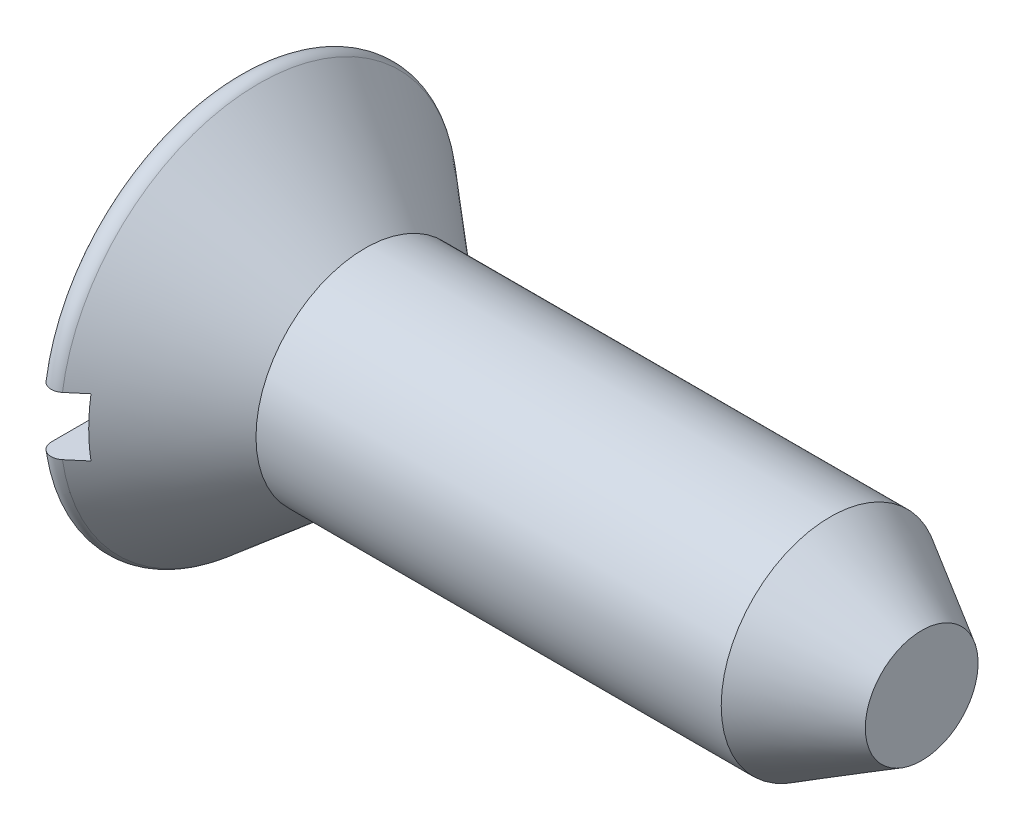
ISO-10303-21;
HEADER;
FILE_DESCRIPTION(('STEP AP214'),'2;1');
FILE_NAME('part.step','',(''),(''),'','','');
FILE_SCHEMA(('AUTOMOTIVE_DESIGN { 1 0 10303 214 1 1 1 1 }'));
ENDSEC;
DATA;
#1=APPLICATION_CONTEXT('core data for automotive mechanical design processes');
#2=APPLICATION_PROTOCOL_DEFINITION('international standard','automotive_design',2000,#1);
#3=PRODUCT_CONTEXT('',#1,'mechanical');
#4=PRODUCT('Part','Part','',(#3));
#5=PRODUCT_RELATED_PRODUCT_CATEGORY('part','',(#4));
#6=PRODUCT_DEFINITION_FORMATION('','',#4);
#7=PRODUCT_DEFINITION_CONTEXT('part definition',#1,'design');
#8=PRODUCT_DEFINITION('design','',#6,#7);
#9=PRODUCT_DEFINITION_SHAPE('','',#8);
#10=(LENGTH_UNIT() NAMED_UNIT(*) SI_UNIT(.MILLI.,.METRE.));
#11=(NAMED_UNIT(*) PLANE_ANGLE_UNIT() SI_UNIT($,.RADIAN.));
#12=(NAMED_UNIT(*) SI_UNIT($,.STERADIAN.) SOLID_ANGLE_UNIT());
#13=UNCERTAINTY_MEASURE_WITH_UNIT(LENGTH_MEASURE(1.E-05),#10,'distance_accuracy_value','');
#14=(GEOMETRIC_REPRESENTATION_CONTEXT(3) GLOBAL_UNCERTAINTY_ASSIGNED_CONTEXT((#13)) GLOBAL_UNIT_ASSIGNED_CONTEXT((#10,
#11,#12)) REPRESENTATION_CONTEXT('',''));
#15=CARTESIAN_POINT('',(0.,0.,0.));
#16=DIRECTION('',(0.,0.,1.));
#17=DIRECTION('',(1.,0.,0.));
#18=AXIS2_PLACEMENT_3D('',#15,#16,#17);
#19=CARTESIAN_POINT('',(0.,0.,0.));
#20=DIRECTION('',(-1.,0.,0.));
#21=DIRECTION('',(0.,0.,1.));
#22=AXIS2_PLACEMENT_3D('',#19,#20,#21);
#23=CYLINDRICAL_SURFACE('',#22,0.762);
#24=CARTESIAN_POINT('',(0.889,0.,0.));
#25=DIRECTION('',(-1.,0.,0.));
#26=DIRECTION('',(0.,0.,1.));
#27=AXIS2_PLACEMENT_3D('',#24,#25,#26);
#28=CIRCLE('',#27,0.762);
#29=CARTESIAN_POINT('',(0.889,0.,0.762));
#30=VERTEX_POINT('',#29);
#31=EDGE_CURVE('E174',#30,#30,#28,.T.);
#32=ORIENTED_EDGE('',*,*,#31,.F.);
#33=EDGE_LOOP('',(#32));
#34=FACE_BOUND('',#33,.T.);
#35=CARTESIAN_POINT('',(4.13728568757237,0.,0.));
#36=DIRECTION('',(-1.,0.,0.));
#37=DIRECTION('',(0.,0.,1.));
#38=AXIS2_PLACEMENT_3D('',#35,#36,#37);
#39=CIRCLE('',#38,0.762);
#40=CARTESIAN_POINT('',(4.13728568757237,0.,0.762));
#41=VERTEX_POINT('',#40);
#42=EDGE_CURVE('E227',#41,#41,#39,.T.);
#43=ORIENTED_EDGE('',*,*,#42,.T.);
#44=EDGE_LOOP('',(#43));
#45=FACE_BOUND('',#44,.T.);
#46=ADVANCED_FACE('F76',(#34,#45),#23,.T.);
#47=CARTESIAN_POINT('',(0.,0.,0.));
#48=DIRECTION('',(1.,0.,0.));
#49=DIRECTION('',(0.,0.,-1.));
#50=AXIS2_PLACEMENT_3D('',#47,#48,#49);
#51=PLANE('',#50);
#52=CARTESIAN_POINT('',(0.,0.,0.));
#53=DIRECTION('',(-1.,0.,0.));
#54=DIRECTION('',(0.,0.,1.));
#55=AXIS2_PLACEMENT_3D('',#52,#53,#54);
#56=CIRCLE('',#55,1.3173129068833);
#57=CARTESIAN_POINT('',(0.,0.2032,1.30154640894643));
#58=VERTEX_POINT('',#57);
#59=CARTESIAN_POINT('',(0.,0.2032,-1.30154640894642));
#60=VERTEX_POINT('',#59);
#61=EDGE_CURVE('E163',#58,#60,#56,.T.);
#62=ORIENTED_EDGE('',*,*,#61,.T.);
#63=DIRECTION('',(0.,0.,1.));
#64=VECTOR('',#63,1.);
#65=CARTESIAN_POINT('',(0.,0.2032,-1.4062129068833));
#66=LINE('',#65,#64);
#67=EDGE_CURVE('E211',#60,#58,#66,.T.);
#68=ORIENTED_EDGE('',*,*,#67,.T.);
#69=EDGE_LOOP('',(#62,#68));
#70=FACE_BOUND('',#69,.T.);
#71=ADVANCED_FACE('F239',(#70),#51,.F.);
#72=CARTESIAN_POINT('',(0.0889,0.,0.));
#73=DIRECTION('',(-1.,0.,0.));
#74=DIRECTION('',(0.,0.,1.));
#75=AXIS2_PLACEMENT_3D('',#72,#73,#74);
#76=TOROIDAL_SURFACE('',#75,1.3173129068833,0.0889000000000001);
#77=CARTESIAN_POINT('',(0.146043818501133,0.,0.));
#78=DIRECTION('',(-1.,0.,0.));
#79=DIRECTION('',(0.,0.,1.));
#80=AXIS2_PLACEMENT_3D('',#77,#78,#79);
#81=CIRCLE('',#80,1.38541425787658);
#82=CARTESIAN_POINT('',(0.146043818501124,0.2032,1.3704314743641));
#83=VERTEX_POINT('',#82);
#84=CARTESIAN_POINT('',(0.146043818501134,0.2032,-1.37043147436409));
#85=VERTEX_POINT('',#84);
#86=EDGE_CURVE('E170',#83,#85,#81,.T.);
#87=ORIENTED_EDGE('',*,*,#86,.T.);
#88=CARTESIAN_POINT('',(0.0523705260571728,0.2032,-1.38351851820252));
#89=CARTESIAN_POINT('',(0.0478176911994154,0.2032,-1.38144422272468));
#90=CARTESIAN_POINT('',(0.0434378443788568,0.2032,-1.37898096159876));
#91=CARTESIAN_POINT('',(0.0351518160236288,0.2032,-1.37334990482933));
#92=CARTESIAN_POINT('',(0.0312462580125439,0.2032,-1.37018119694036));
#93=CARTESIAN_POINT('',(0.0240245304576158,0.2032,-1.36323710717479));
#94=CARTESIAN_POINT('',(0.0207078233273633,0.2032,-1.35946228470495));
#95=CARTESIAN_POINT('',(0.0147503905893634,0.2032,-1.35141429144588));
#96=CARTESIAN_POINT('',(0.0121095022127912,0.2032,-1.34714124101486));
#97=CARTESIAN_POINT('',(0.00755405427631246,0.2032,-1.33818164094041));
#98=CARTESIAN_POINT('',(0.00564538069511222,0.2032,-1.33349209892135));
#99=CARTESIAN_POINT('',(0.00263372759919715,0.2032,-1.32386086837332));
#100=CARTESIAN_POINT('',(0.00153082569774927,0.2032,-1.31891915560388));
#101=CARTESIAN_POINT('',(0.000152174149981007,0.2032,-1.30887237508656));
#102=CARTESIAN_POINT('',(-0.000115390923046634,0.2032,-1.30376618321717));
#103=CARTESIAN_POINT('',(0.000206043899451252,0.2032,-1.29358074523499));
#104=CARTESIAN_POINT('',(0.000795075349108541,0.2032,-1.28850150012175));
#105=CARTESIAN_POINT('',(0.00281857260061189,0.2032,-1.27848876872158));
#106=CARTESIAN_POINT('',(0.00425707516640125,0.2032,-1.27355609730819));
#107=CARTESIAN_POINT('',(0.00794412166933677,0.2032,-1.26400323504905));
#108=CARTESIAN_POINT('',(0.0101926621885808,0.2032,-1.25938304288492));
#109=CARTESIAN_POINT('',(0.015431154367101,0.2032,-1.25060241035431));
#110=CARTESIAN_POINT('',(0.0184188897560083,0.2032,-1.24644064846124));
#111=CARTESIAN_POINT('',(0.025057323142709,0.2032,-1.23868432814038));
#112=CARTESIAN_POINT('',(0.0287079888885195,0.2032,-1.23508974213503));
#113=CARTESIAN_POINT('',(0.036529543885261,0.2032,-1.22861027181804));
#114=CARTESIAN_POINT('',(0.0406947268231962,0.2032,-1.2257185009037));
#115=CARTESIAN_POINT('',(0.049456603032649,0.2032,-1.22068615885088));
#116=CARTESIAN_POINT('',(0.0540532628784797,0.2032,-1.21854552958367));
#117=CARTESIAN_POINT('',(0.0634830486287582,0.2032,-1.21510523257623));
#118=CARTESIAN_POINT('',(0.068312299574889,0.2032,-1.21379494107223));
#119=CARTESIAN_POINT('',(0.0781229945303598,0.2032,-1.21201227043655));
#120=CARTESIAN_POINT('',(0.0831044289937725,0.2032,-1.21153983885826));
#121=CARTESIAN_POINT('',(0.0930285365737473,0.2032,-1.21144808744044));
#122=CARTESIAN_POINT('',(0.0979711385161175,0.2032,-1.21182086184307));
#123=CARTESIAN_POINT('',(0.107723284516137,0.2032,-1.21339163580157));
#124=CARTESIAN_POINT('',(0.112532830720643,0.2032,-1.21458962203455));
#125=CARTESIAN_POINT('',(0.121880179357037,0.2032,-1.21777299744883));
#126=CARTESIAN_POINT('',(0.126418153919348,0.2032,-1.21975788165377));
#127=CARTESIAN_POINT('',(0.135100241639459,0.2032,-1.22445530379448));
#128=CARTESIAN_POINT('',(0.139244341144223,0.2032,-1.2271678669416));
#129=CARTESIAN_POINT('',(0.147058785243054,0.2032,-1.23326619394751));
#130=CARTESIAN_POINT('',(0.150724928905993,0.2032,-1.23665733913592));
#131=CARTESIAN_POINT('',(0.157444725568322,0.2032,-1.2440000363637));
#132=CARTESIAN_POINT('',(0.160498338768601,0.2032,-1.24795162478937));
#133=CARTESIAN_POINT('',(0.165947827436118,0.2032,-1.25635718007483));
#134=CARTESIAN_POINT('',(0.168334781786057,0.2032,-1.2608169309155));
#135=CARTESIAN_POINT('',(0.172335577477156,0.2032,-1.27007068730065));
#136=CARTESIAN_POINT('',(0.17394936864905,0.2032,-1.27486471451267));
#137=CARTESIAN_POINT('',(0.176375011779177,0.2032,-1.28470805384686));
#138=CARTESIAN_POINT('',(0.177177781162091,0.2032,-1.28975960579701));
#139=CARTESIAN_POINT('',(0.177928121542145,0.2032,-1.29992591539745));
#140=CARTESIAN_POINT('',(0.177875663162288,0.2032,-1.30504067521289));
#141=CARTESIAN_POINT('',(0.176913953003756,0.2032,-1.31521251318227));
#142=CARTESIAN_POINT('',(0.176000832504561,0.2032,-1.32026922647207));
#143=CARTESIAN_POINT('',(0.173335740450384,0.2032,-1.33015669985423));
#144=CARTESIAN_POINT('',(0.171583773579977,0.2032,-1.33498746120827));
#145=CARTESIAN_POINT('',(0.1672950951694,0.2032,-1.34426719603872));
#146=CARTESIAN_POINT('',(0.164761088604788,0.2032,-1.34871741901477));
#147=CARTESIAN_POINT('',(0.158975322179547,0.2032,-1.35712403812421));
#148=CARTESIAN_POINT('',(0.155723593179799,0.2032,-1.36108045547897));
#149=CARTESIAN_POINT('',(0.148626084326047,0.2032,-1.3683476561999));
#150=CARTESIAN_POINT('',(0.144786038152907,0.2032,-1.371664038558));
#151=CARTESIAN_POINT('',(0.136598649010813,0.2032,-1.3775964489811));
#152=CARTESIAN_POINT('',(0.13225135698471,0.2032,-1.38021254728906));
#153=CARTESIAN_POINT('',(0.123223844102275,0.2032,-1.38464056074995));
#154=CARTESIAN_POINT('',(0.118547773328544,0.2032,-1.38646093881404));
#155=CARTESIAN_POINT('',(0.108953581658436,0.2032,-1.38928396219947));
#156=CARTESIAN_POINT('',(0.104035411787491,0.2032,-1.39028644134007));
#157=CARTESIAN_POINT('',(0.0941387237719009,0.2032,-1.39143812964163));
#158=CARTESIAN_POINT('',(0.0891609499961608,0.2032,-1.39159377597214));
#159=CARTESIAN_POINT('',(0.0792546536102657,0.2032,-1.39106395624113));
#160=CARTESIAN_POINT('',(0.0743260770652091,0.2032,-1.39037954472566));
#161=CARTESIAN_POINT('',(0.0665501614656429,0.2032,-1.38862203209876));
#162=CARTESIAN_POINT('',(0.0636423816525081,0.2032,-1.38780545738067));
#163=CARTESIAN_POINT('',(0.0579255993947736,0.2032,-1.38587926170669));
#164=CARTESIAN_POINT('',(0.0551165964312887,0.2032,-1.38476964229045));
#165=CARTESIAN_POINT('',(0.0523705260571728,0.2032,-1.38351851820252));
#166=B_SPLINE_CURVE_WITH_KNOTS('',3,(#88,#89,#90,#91,#92,#93,#94,#95,#96,#97,#98,#99,#100,#101,
#102,#103,#104,#105,#106,#107,#108,#109,#110,#111,#112,#113,#114,#115,#116,#117,#118,#119,#120,
#121,#122,#123,#124,#125,#126,#127,#128,#129,#130,#131,#132,#133,#134,#135,#136,#137,#138,#139,
#140,#141,#142,#143,#144,#145,#146,#147,#148,#149,#150,#151,#152,#153,#154,#155,#156,#157,#158,
#159,#160,#161,#162,#163,#164,#165),.UNSPECIFIED.,.T.,.F.,(4,2,2,2,2,2,2,2,2,2,2,2,2,2,2,2,2,2,
2,2,2,2,2,2,2,2,2,2,2,2,2,2,2,2,2,2,2,2,4),(0.,0.0149981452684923,0.030015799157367,
0.0450196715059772,0.0600199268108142,0.075138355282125,0.0902582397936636,0.105525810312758,
0.120793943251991,0.136135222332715,0.151476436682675,0.166772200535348,0.182067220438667,
0.197205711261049,0.212343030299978,0.227282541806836,0.242221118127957,0.257020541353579,
0.271819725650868,0.286609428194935,0.301399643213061,0.316312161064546,0.331225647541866,
0.346330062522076,0.361435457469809,0.37670820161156,0.391981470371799,0.4073237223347,
0.422665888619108,0.437955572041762,0.453244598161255,0.468393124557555,0.483540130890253,
0.498521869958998,0.513506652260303,0.528377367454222,0.543229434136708,0.552275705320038,
0.561321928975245),.UNSPECIFIED.);
#167=EDGE_CURVE('E182',#85,#60,#166,.T.);
#168=ORIENTED_EDGE('',*,*,#167,.T.);
#169=ORIENTED_EDGE('',*,*,#61,.F.);
#170=CARTESIAN_POINT('',(0.0505339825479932,0.2032,1.22031559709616));
#171=CARTESIAN_POINT('',(0.046022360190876,0.2032,1.22250397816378));
#172=CARTESIAN_POINT('',(0.0416938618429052,0.2032,1.22507887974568));
#173=CARTESIAN_POINT('',(0.0335289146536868,0.2032,1.23092350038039));
#174=CARTESIAN_POINT('',(0.0296931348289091,0.2032,1.23419414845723));
#175=CARTESIAN_POINT('',(0.0226268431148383,0.2032,1.24132795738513));
#176=CARTESIAN_POINT('',(0.019395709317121,0.2032,1.24519050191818));
#177=CARTESIAN_POINT('',(0.0136214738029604,0.2032,1.25339760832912));
#178=CARTESIAN_POINT('',(0.0110782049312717,0.2032,1.25774205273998));
#179=CARTESIAN_POINT('',(0.00672420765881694,0.2032,1.26683485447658));
#180=CARTESIAN_POINT('',(0.00492070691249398,0.2032,1.271586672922));
#181=CARTESIAN_POINT('',(0.00212891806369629,0.2032,1.28132430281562));
#182=CARTESIAN_POINT('',(0.00114070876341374,0.2032,1.28631013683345));
#183=CARTESIAN_POINT('',(8.02056667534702E-07,0.2032,1.29642193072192));
#184=CARTESIAN_POINT('',(-0.000143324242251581,0.2032,1.30154874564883));
#185=CARTESIAN_POINT('',(0.000429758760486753,0.2032,1.31175411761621));
#186=CARTESIAN_POINT('',(0.00114698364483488,0.2032,1.31683267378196));
#187=CARTESIAN_POINT('',(0.00342616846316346,0.2032,1.3268042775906));
#188=CARTESIAN_POINT('',(0.0049893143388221,0.2032,1.33169705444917));
#189=CARTESIAN_POINT('',(0.00891975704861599,0.2032,1.34114832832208));
#190=CARTESIAN_POINT('',(0.0112870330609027,0.2032,1.3457068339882));
#191=CARTESIAN_POINT('',(0.0167446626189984,0.2032,1.35432961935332));
#192=CARTESIAN_POINT('',(0.0198305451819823,0.2032,1.3583967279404));
#193=CARTESIAN_POINT('',(0.0266478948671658,0.2032,1.36594827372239));
#194=CARTESIAN_POINT('',(0.0303793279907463,0.2032,1.3694327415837));
#195=CARTESIAN_POINT('',(0.0383405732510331,0.2032,1.37568129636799));
#196=CARTESIAN_POINT('',(0.0425648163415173,0.2032,1.37845247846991));
#197=CARTESIAN_POINT('',(0.0514223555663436,0.2032,1.38323774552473));
#198=CARTESIAN_POINT('',(0.0560556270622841,0.2032,1.38525187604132));
#199=CARTESIAN_POINT('',(0.0655486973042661,0.2032,1.38844509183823));
#200=CARTESIAN_POINT('',(0.0704056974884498,0.2032,1.3896324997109));
#201=CARTESIAN_POINT('',(0.0802504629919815,0.2032,1.39116939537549));
#202=CARTESIAN_POINT('',(0.085238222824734,0.2032,1.39151891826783));
#203=CARTESIAN_POINT('',(0.0951701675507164,0.2032,1.39136993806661));
#204=CARTESIAN_POINT('',(0.100114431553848,0.2032,1.39087664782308));
#205=CARTESIAN_POINT('',(0.109849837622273,0.2032,1.38906691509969));
#206=CARTESIAN_POINT('',(0.114640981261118,0.2032,1.38775048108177));
#207=CARTESIAN_POINT('',(0.123935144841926,0.2032,1.3843337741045));
#208=CARTESIAN_POINT('',(0.128438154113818,0.2032,1.38223347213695));
#209=CARTESIAN_POINT('',(0.137030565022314,0.2032,1.37731112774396));
#210=CARTESIAN_POINT('',(0.141119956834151,0.2032,1.37448906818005));
#211=CARTESIAN_POINT('',(0.148796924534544,0.2032,1.36818585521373));
#212=CARTESIAN_POINT('',(0.152381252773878,0.2032,1.36470074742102));
#213=CARTESIAN_POINT('',(0.158921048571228,0.2032,1.35718357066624));
#214=CARTESIAN_POINT('',(0.161876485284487,0.2032,1.35315147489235));
#215=CARTESIAN_POINT('',(0.167106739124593,0.2032,1.34461137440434));
#216=CARTESIAN_POINT('',(0.169374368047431,0.2032,1.34009896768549));
#217=CARTESIAN_POINT('',(0.173128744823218,0.2032,1.33076025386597));
#218=CARTESIAN_POINT('',(0.174615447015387,0.2032,1.32593392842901));
#219=CARTESIAN_POINT('',(0.176781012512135,0.2032,1.3160508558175));
#220=CARTESIAN_POINT('',(0.17745135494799,0.2032,1.31099224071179));
#221=CARTESIAN_POINT('',(0.177939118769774,0.2032,1.30083399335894));
#222=CARTESIAN_POINT('',(0.17775650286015,0.2032,1.29573435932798));
#223=CARTESIAN_POINT('',(0.17653988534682,0.2032,1.28560487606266));
#224=CARTESIAN_POINT('',(0.175500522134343,0.2032,1.28057566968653));
#225=CARTESIAN_POINT('',(0.172591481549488,0.2032,1.27076324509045));
#226=CARTESIAN_POINT('',(0.170721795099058,0.2032,1.26598002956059));
#227=CARTESIAN_POINT('',(0.166204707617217,0.2032,1.25680196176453));
#228=CARTESIAN_POINT('',(0.163558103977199,0.2032,1.25240671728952));
#229=CARTESIAN_POINT('',(0.157558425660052,0.2032,1.24412800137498));
#230=CARTESIAN_POINT('',(0.154205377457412,0.2032,1.24024451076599));
#231=CARTESIAN_POINT('',(0.146918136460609,0.2032,1.23313728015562));
#232=CARTESIAN_POINT('',(0.14298928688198,0.2032,1.22990806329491));
#233=CARTESIAN_POINT('',(0.134639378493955,0.2032,1.22416552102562));
#234=CARTESIAN_POINT('',(0.130218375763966,0.2032,1.22165211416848));
#235=CARTESIAN_POINT('',(0.121071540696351,0.2032,1.21744707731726));
#236=CARTESIAN_POINT('',(0.116350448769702,0.2032,1.21574513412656));
#237=CARTESIAN_POINT('',(0.106686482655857,0.2032,1.21316740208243));
#238=CARTESIAN_POINT('',(0.101743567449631,0.2032,1.2122917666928));
#239=CARTESIAN_POINT('',(0.0918327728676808,0.2032,1.21139933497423));
#240=CARTESIAN_POINT('',(0.0868656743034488,0.2032,1.21137379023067));
#241=CARTESIAN_POINT('',(0.0770026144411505,0.2032,1.21216050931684));
#242=CARTESIAN_POINT('',(0.0721065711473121,0.2032,1.21297171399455));
#243=CARTESIAN_POINT('',(0.0644247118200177,0.2032,1.21492056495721));
#244=CARTESIAN_POINT('',(0.0615712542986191,0.2032,1.21580160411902));
#245=CARTESIAN_POINT('',(0.0559682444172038,0.2032,1.21784800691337));
#246=CARTESIAN_POINT('',(0.0532186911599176,0.2032,1.21901336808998));
#247=CARTESIAN_POINT('',(0.0505339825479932,0.2032,1.22031559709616));
#248=B_SPLINE_CURVE_WITH_KNOTS('',3,(#170,#171,#172,#173,#174,#175,#176,#177,#178,#179,#180,
#181,#182,#183,#184,#185,#186,#187,#188,#189,#190,#191,#192,#193,#194,#195,#196,#197,#198,#199,
#200,#201,#202,#203,#204,#205,#206,#207,#208,#209,#210,#211,#212,#213,#214,#215,#216,#217,#218,
#219,#220,#221,#222,#223,#224,#225,#226,#227,#228,#229,#230,#231,#232,#233,#234,#235,#236,#237,
#238,#239,#240,#241,#242,#243,#244,#245,#246,#247),.UNSPECIFIED.,.T.,.F.,(4,2,2,2,2,2,2,2,2,2,2,
2,2,2,2,2,2,2,2,2,2,2,2,2,2,2,2,2,2,2,2,2,2,2,2,2,2,2,4),(0.,0.0150319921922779,
0.03008418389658,0.0451208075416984,0.0601537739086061,0.0753303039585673,0.0905083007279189,
0.105822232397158,0.121136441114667,0.13647217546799,0.151807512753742,0.167049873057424,
0.182291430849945,0.197374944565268,0.21245755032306,0.227386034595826,0.242313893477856,
0.257149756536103,0.271985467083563,0.28682172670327,0.301658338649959,0.316586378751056,
0.331515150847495,0.346594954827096,0.361675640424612,0.376912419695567,0.392149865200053,
0.407483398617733,0.422817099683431,0.438135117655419,0.453452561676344,0.468635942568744,
0.483817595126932,0.498800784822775,0.513786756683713,0.528618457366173,0.543431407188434,
0.552376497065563,0.561321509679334),.UNSPECIFIED.);
#249=EDGE_CURVE('E177',#58,#83,#248,.T.);
#250=ORIENTED_EDGE('',*,*,#249,.T.);
#251=EDGE_LOOP('',(#87,#168,#169,#250));
#252=FACE_BOUND('',#251,.T.);
#253=ADVANCED_FACE('F219',(#252),#76,.T.);
#254=CARTESIAN_POINT('',(0.,-0.2032,-1.30154640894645));
#255=VERTEX_POINT('',#254);
#256=CARTESIAN_POINT('',(0.,-0.2032,1.30154640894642));
#257=VERTEX_POINT('',#256);
#258=EDGE_CURVE('E165',#255,#257,#56,.T.);
#259=ORIENTED_EDGE('',*,*,#258,.T.);
#260=DIRECTION('',(0.,0.,1.));
#261=VECTOR('',#260,1.);
#262=CARTESIAN_POINT('',(0.,-0.2032,-1.4062129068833));
#263=LINE('',#262,#261);
#264=EDGE_CURVE('E149',#255,#257,#263,.T.);
#265=ORIENTED_EDGE('',*,*,#264,.F.);
#266=EDGE_LOOP('',(#259,#265));
#267=FACE_BOUND('',#266,.T.);
#268=ADVANCED_FACE('F78',(#267),#51,.F.);
#269=ORIENTED_EDGE('',*,*,#258,.F.);
#270=CARTESIAN_POINT('',(0.0523705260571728,-0.2032,-1.38351851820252));
#271=CARTESIAN_POINT('',(0.0568738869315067,-0.2032,-1.38556977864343));
#272=CARTESIAN_POINT('',(0.0615529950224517,-0.2032,-1.38724351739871));
#273=CARTESIAN_POINT('',(0.0711294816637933,-0.2032,-1.38978319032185));
#274=CARTESIAN_POINT('',(0.0760270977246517,-0.2032,-1.39064822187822));
#275=CARTESIAN_POINT('',(0.085896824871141,-0.2032,-1.39154221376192));
#276=CARTESIAN_POINT('',(0.0908689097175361,-0.2032,-1.39157146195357));
#277=CARTESIAN_POINT('',(0.100745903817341,-0.2032,-1.39079351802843));
#278=CARTESIAN_POINT('',(0.105650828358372,-0.2032,-1.38998651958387));
#279=CARTESIAN_POINT('',(0.115250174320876,-0.2032,-1.38756210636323));
#280=CARTESIAN_POINT('',(0.11994482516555,-0.2032,-1.38594559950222));
#281=CARTESIAN_POINT('',(0.128997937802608,-0.2032,-1.38195064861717));
#282=CARTESIAN_POINT('',(0.133356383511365,-0.2032,-1.3795721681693));
#283=CARTESIAN_POINT('',(0.141634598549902,-0.2032,-1.37411112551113));
#284=CARTESIAN_POINT('',(0.145552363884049,-0.2032,-1.37102552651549));
#285=CARTESIAN_POINT('',(0.15282015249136,-0.2032,-1.36424588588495));
#286=CARTESIAN_POINT('',(0.156170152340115,-0.2032,-1.36055181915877));
#287=CARTESIAN_POINT('',(0.162240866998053,-0.2032,-1.35262411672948));
#288=CARTESIAN_POINT('',(0.164955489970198,-0.2032,-1.34838581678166));
#289=CARTESIAN_POINT('',(0.169643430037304,-0.2032,-1.33951742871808));
#290=CARTESIAN_POINT('',(0.17161670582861,-0.2032,-1.3348873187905));
#291=CARTESIAN_POINT('',(0.174787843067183,-0.2032,-1.32531348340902));
#292=CARTESIAN_POINT('',(0.175977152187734,-0.2032,-1.32036692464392));
#293=CARTESIAN_POINT('',(0.177515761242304,-0.2032,-1.3103448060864));
#294=CARTESIAN_POINT('',(0.177865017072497,-0.2032,-1.30526923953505));
#295=CARTESIAN_POINT('',(0.177714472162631,-0.2032,-1.29508994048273));
#296=CARTESIAN_POINT('',(0.177207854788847,-0.2032,-1.28998630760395));
#297=CARTESIAN_POINT('',(0.175346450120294,-0.2032,-1.27993599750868));
#298=CARTESIAN_POINT('',(0.173991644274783,-0.2032,-1.27498932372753));
#299=CARTESIAN_POINT('',(0.170467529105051,-0.2032,-1.26538662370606));
#300=CARTESIAN_POINT('',(0.16829701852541,-0.2032,-1.26073103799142));
#301=CARTESIAN_POINT('',(0.163200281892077,-0.2032,-1.25185353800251));
#302=CARTESIAN_POINT('',(0.160274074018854,-0.2032,-1.2476316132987));
#303=CARTESIAN_POINT('',(0.153767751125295,-0.2032,-1.23977238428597));
#304=CARTESIAN_POINT('',(0.150192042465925,-0.2032,-1.23613143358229));
#305=CARTESIAN_POINT('',(0.14247343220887,-0.2032,-1.22951058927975));
#306=CARTESIAN_POINT('',(0.138330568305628,-0.2032,-1.22653065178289));
#307=CARTESIAN_POINT('',(0.12964941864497,-0.2032,-1.2213558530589));
#308=CARTESIAN_POINT('',(0.125116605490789,-0.2032,-1.21915181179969));
#309=CARTESIAN_POINT('',(0.11574215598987,-0.2032,-1.21554678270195));
#310=CARTESIAN_POINT('',(0.110900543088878,-0.2032,-1.21414573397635));
#311=CARTESIAN_POINT('',(0.101109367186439,-0.2032,-1.21220274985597));
#312=CARTESIAN_POINT('',(0.0961618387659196,-0.2032,-1.21165055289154));
#313=CARTESIAN_POINT('',(0.086244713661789,-0.2032,-1.21138997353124));
#314=CARTESIAN_POINT('',(0.0812751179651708,-0.2032,-1.21168155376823));
#315=CARTESIAN_POINT('',(0.0714850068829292,-0.2032,-1.21309522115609));
#316=CARTESIAN_POINT('',(0.066663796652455,-0.2032,-1.21421250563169));
#317=CARTESIAN_POINT('',(0.0572763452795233,-0.2032,-1.21723776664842));
#318=CARTESIAN_POINT('',(0.0527101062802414,-0.2032,-1.21914574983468));
#319=CARTESIAN_POINT('',(0.0439429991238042,-0.2032,-1.2237033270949));
#320=CARTESIAN_POINT('',(0.0397435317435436,-0.2032,-1.22635561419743));
#321=CARTESIAN_POINT('',(0.0318431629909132,-0.2032,-1.23232032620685));
#322=CARTESIAN_POINT('',(0.0281422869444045,-0.2032,-1.23563278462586));
#323=CARTESIAN_POINT('',(0.0212998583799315,-0.2032,-1.24286228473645));
#324=CARTESIAN_POINT('',(0.0181649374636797,-0.2032,-1.2467856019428));
#325=CARTESIAN_POINT('',(0.0125883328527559,-0.2032,-1.25509730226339));
#326=CARTESIAN_POINT('',(0.0101466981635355,-0.2032,-1.25948571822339));
#327=CARTESIAN_POINT('',(0.00599383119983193,-0.2032,-1.26866335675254));
#328=CARTESIAN_POINT('',(0.00429233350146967,-0.2032,-1.27345698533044));
#329=CARTESIAN_POINT('',(0.00171053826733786,-0.2032,-1.28326056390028));
#330=CARTESIAN_POINT('',(0.000830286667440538,-0.2032,-1.28827052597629));
#331=CARTESIAN_POINT('',(-8.94328821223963E-05,-0.2032,-1.29841043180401));
#332=CARTESIAN_POINT('',(-0.00012164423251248,-0.2032,-1.30354103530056));
#333=CARTESIAN_POINT('',(0.000674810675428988,-0.2032,-1.31373491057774));
#334=CARTESIAN_POINT('',(0.00150345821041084,-0.2032,-1.31879818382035));
#335=CARTESIAN_POINT('',(0.00400129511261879,-0.2032,-1.32871729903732));
#336=CARTESIAN_POINT('',(0.00567113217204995,-0.2032,-1.33357297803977));
#337=CARTESIAN_POINT('',(0.00980803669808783,-0.2032,-1.34293367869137));
#338=CARTESIAN_POINT('',(0.0122752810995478,-0.2032,-1.34743862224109));
#339=CARTESIAN_POINT('',(0.0179219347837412,-0.2032,-1.3559381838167));
#340=CARTESIAN_POINT('',(0.0210969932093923,-0.2032,-1.35993569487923));
#341=CARTESIAN_POINT('',(0.0280775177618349,-0.2032,-1.3673298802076));
#342=CARTESIAN_POINT('',(0.0318821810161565,-0.2032,-1.37072730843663));
#343=CARTESIAN_POINT('',(0.0384979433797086,-0.2032,-1.37568731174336));
#344=CARTESIAN_POINT('',(0.0411524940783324,-0.2032,-1.37746243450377));
#345=CARTESIAN_POINT('',(0.0466371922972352,-0.2032,-1.3807168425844));
#346=CARTESIAN_POINT('',(0.0494673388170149,-0.2032,-1.38219612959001));
#347=CARTESIAN_POINT('',(0.0523705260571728,-0.2032,-1.38351851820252));
#348=B_SPLINE_CURVE_WITH_KNOTS('',3,(#270,#271,#272,#273,#274,#275,#276,#277,#278,#279,#280,
#281,#282,#283,#284,#285,#286,#287,#288,#289,#290,#291,#292,#293,#294,#295,#296,#297,#298,#299,
#300,#301,#302,#303,#304,#305,#306,#307,#308,#309,#310,#311,#312,#313,#314,#315,#316,#317,#318,
#319,#320,#321,#322,#323,#324,#325,#326,#327,#328,#329,#330,#331,#332,#333,#334,#335,#336,#337,
#338,#339,#340,#341,#342,#343,#344,#345,#346,#347),.UNSPECIFIED.,.T.,.F.,(4,2,2,2,2,2,2,2,2,2,2,
2,2,2,2,2,2,2,2,2,2,2,2,2,2,2,2,2,2,2,2,2,2,2,2,2,2,2,4),(0.,0.0148340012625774,
0.0296845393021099,0.044529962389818,0.0593719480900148,0.074197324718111,0.0890234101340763,
0.103914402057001,0.118806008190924,0.133835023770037,0.148864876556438,0.164056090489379,
0.179248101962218,0.194561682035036,0.209875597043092,0.225212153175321,0.240548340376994,
0.255784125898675,0.271018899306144,0.286066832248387,0.301113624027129,0.315977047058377,
0.330839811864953,0.345616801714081,0.360393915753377,0.375225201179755,0.390057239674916,
0.405053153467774,0.420050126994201,0.435238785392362,0.450428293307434,0.465747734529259,
0.481066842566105,0.496397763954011,0.511732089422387,0.526974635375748,0.542197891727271,
0.551761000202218,0.561324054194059),.UNSPECIFIED.);
#349=CARTESIAN_POINT('',(0.146043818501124,-0.2032,-1.3704314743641));
#350=VERTEX_POINT('',#349);
#351=EDGE_CURVE('E210',#255,#350,#348,.T.);
#352=ORIENTED_EDGE('',*,*,#351,.T.);
#353=CARTESIAN_POINT('',(0.146043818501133,-0.2032,1.37043147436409));
#354=VERTEX_POINT('',#353);
#355=EDGE_CURVE('E155',#350,#354,#81,.T.);
#356=ORIENTED_EDGE('',*,*,#355,.T.);
#357=CARTESIAN_POINT('',(0.0505339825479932,-0.2032,1.22031559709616));
#358=CARTESIAN_POINT('',(0.05497646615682,-0.2032,1.21816125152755));
#359=CARTESIAN_POINT('',(0.059602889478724,-0.2032,1.21637848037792));
#360=CARTESIAN_POINT('',(0.0690928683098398,-0.2032,1.21361305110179));
#361=CARTESIAN_POINT('',(0.0739566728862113,-0.2032,1.21263125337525));
#362=CARTESIAN_POINT('',(0.0837793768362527,-0.2032,1.21150030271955));
#363=CARTESIAN_POINT('',(0.0887382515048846,-0.2032,1.21135093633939));
#364=CARTESIAN_POINT('',(0.0986091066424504,-0.2032,1.21188917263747));
#365=CARTESIAN_POINT('',(0.103521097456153,-0.2032,1.21257658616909));
#366=CARTESIAN_POINT('',(0.113149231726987,-0.2032,1.21476429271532));
#367=CARTESIAN_POINT('',(0.117865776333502,-0.2032,1.21626282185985));
#368=CARTESIAN_POINT('',(0.126982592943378,-0.2032,1.22002606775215));
#369=CARTESIAN_POINT('',(0.131382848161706,-0.2032,1.22229082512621));
#370=CARTESIAN_POINT('',(0.139770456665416,-0.2032,1.22753418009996));
#371=CARTESIAN_POINT('',(0.143755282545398,-0.2032,1.23051681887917));
#372=CARTESIAN_POINT('',(0.151175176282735,-0.2032,1.23710141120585));
#373=CARTESIAN_POINT('',(0.154610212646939,-0.2032,1.24070340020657));
#374=CARTESIAN_POINT('',(0.160877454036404,-0.2032,1.24847052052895));
#375=CARTESIAN_POINT('',(0.163701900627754,-0.2032,1.25264191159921));
#376=CARTESIAN_POINT('',(0.168620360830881,-0.2032,1.26139508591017));
#377=CARTESIAN_POINT('',(0.170714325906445,-0.2032,1.26597689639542));
#378=CARTESIAN_POINT('',(0.174138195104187,-0.2032,1.2754812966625));
#379=CARTESIAN_POINT('',(0.175458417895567,-0.2032,1.28040737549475));
#380=CARTESIAN_POINT('',(0.177259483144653,-0.2032,1.2904107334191));
#381=CARTESIAN_POINT('',(0.177740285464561,-0.2032,1.29548801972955));
#382=CARTESIAN_POINT('',(0.177849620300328,-0.2032,1.30568694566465));
#383=CARTESIAN_POINT('',(0.177472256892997,-0.2032,1.31080864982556));
#384=CARTESIAN_POINT('',(0.17586224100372,-0.2032,1.32091594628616));
#385=CARTESIAN_POINT('',(0.174629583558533,-0.2032,1.32590153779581));
#386=CARTESIAN_POINT('',(0.171342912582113,-0.2032,1.33558868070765));
#387=CARTESIAN_POINT('',(0.169289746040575,-0.2032,1.34029051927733));
#388=CARTESIAN_POINT('',(0.16441718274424,-0.2032,1.34927898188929));
#389=CARTESIAN_POINT('',(0.16159781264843,-0.2032,1.35356562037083));
#390=CARTESIAN_POINT('',(0.155295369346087,-0.2032,1.36156540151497));
#391=CARTESIAN_POINT('',(0.151817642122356,-0.2032,1.36528275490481));
#392=CARTESIAN_POINT('',(0.144281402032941,-0.2032,1.37207299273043));
#393=CARTESIAN_POINT('',(0.140222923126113,-0.2032,1.37514591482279));
#394=CARTESIAN_POINT('',(0.13168742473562,-0.2032,1.38052482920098));
#395=CARTESIAN_POINT('',(0.127215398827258,-0.2032,1.38283874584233));
#396=CARTESIAN_POINT('',(0.117943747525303,-0.2032,1.3866747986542));
#397=CARTESIAN_POINT('',(0.11314414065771,-0.2032,1.38819697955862));
#398=CARTESIAN_POINT('',(0.103401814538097,-0.2032,1.39039274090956));
#399=CARTESIAN_POINT('',(0.0984608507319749,-0.2032,1.39107411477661));
#400=CARTESIAN_POINT('',(0.0885348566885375,-0.2032,1.39159359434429));
#401=CARTESIAN_POINT('',(0.0835498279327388,-0.2032,1.3914317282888));
#402=CARTESIAN_POINT('',(0.073700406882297,-0.2032,1.39027227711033));
#403=CARTESIAN_POINT('',(0.0688355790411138,-0.2032,1.38927838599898));
#404=CARTESIAN_POINT('',(0.0593413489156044,-0.2032,1.38648952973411));
#405=CARTESIAN_POINT('',(0.0547119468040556,-0.2032,1.3846945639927));
#406=CARTESIAN_POINT('',(0.04580915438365,-0.2032,1.38035246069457));
#407=CARTESIAN_POINT('',(0.0415364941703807,-0.2032,1.37780382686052));
#408=CARTESIAN_POINT('',(0.0334754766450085,-0.2032,1.37203056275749));
#409=CARTESIAN_POINT('',(0.0296871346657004,-0.2032,1.36880591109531));
#410=CARTESIAN_POINT('',(0.0226704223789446,-0.2032,1.36174652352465));
#411=CARTESIAN_POINT('',(0.0194465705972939,-0.2032,1.35790729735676));
#412=CARTESIAN_POINT('',(0.0136811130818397,-0.2032,1.34974691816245));
#413=CARTESIAN_POINT('',(0.0111395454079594,-0.2032,1.34542573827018));
#414=CARTESIAN_POINT('',(0.00678214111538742,-0.2032,1.33637504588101));
#415=CARTESIAN_POINT('',(0.00497430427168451,-0.2032,1.33164168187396));
#416=CARTESIAN_POINT('',(0.00217045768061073,-0.2032,1.32194031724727));
#417=CARTESIAN_POINT('',(0.00117449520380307,-0.2032,1.31697230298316));
#418=CARTESIAN_POINT('',(1.4106707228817E-05,-0.2032,1.306891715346));
#419=CARTESIAN_POINT('',(-0.000142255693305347,-0.2032,1.30177821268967));
#420=CARTESIAN_POINT('',(0.000401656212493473,-0.2032,1.29159706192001));
#421=CARTESIAN_POINT('',(0.00110192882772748,-0.2032,1.28652941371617));
#422=CARTESIAN_POINT('',(0.00334487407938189,-0.2032,1.2765613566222));
#423=CARTESIAN_POINT('',(0.00489110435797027,-0.2032,1.27166174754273));
#424=CARTESIAN_POINT('',(0.00878745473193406,-0.2032,1.26219159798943));
#425=CARTESIAN_POINT('',(0.0111377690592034,-0.2032,1.2576211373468));
#426=CARTESIAN_POINT('',(0.0165696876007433,-0.2032,1.24895726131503));
#427=CARTESIAN_POINT('',(0.0196490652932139,-0.2032,1.24486244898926));
#428=CARTESIAN_POINT('',(0.0264562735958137,-0.2032,1.23725886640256));
#429=CARTESIAN_POINT('',(0.0301832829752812,-0.2032,1.23374936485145));
#430=CARTESIAN_POINT('',(0.0367087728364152,-0.2032,1.22858335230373));
#431=CARTESIAN_POINT('',(0.0393459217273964,-0.2032,1.22671953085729));
#432=CARTESIAN_POINT('',(0.0448071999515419,-0.2032,1.22328946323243));
#433=CARTESIAN_POINT('',(0.0476313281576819,-0.2032,1.2217232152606));
#434=CARTESIAN_POINT('',(0.0505339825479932,-0.2032,1.22031559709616));
#435=B_SPLINE_CURVE_WITH_KNOTS('',3,(#357,#358,#359,#360,#361,#362,#363,#364,#365,#366,#367,
#368,#369,#370,#371,#372,#373,#374,#375,#376,#377,#378,#379,#380,#381,#382,#383,#384,#385,#386,
#387,#388,#389,#390,#391,#392,#393,#394,#395,#396,#397,#398,#399,#400,#401,#402,#403,#404,#405,
#406,#407,#408,#409,#410,#411,#412,#413,#414,#415,#416,#417,#418,#419,#420,#421,#422,#423,#424,
#425,#426,#427,#428,#429,#430,#431,#432,#433,#434),.UNSPECIFIED.,.T.,.F.,(4,2,2,2,2,2,2,2,2,2,2,
2,2,2,2,2,2,2,2,2,2,2,2,2,2,2,2,2,2,2,2,2,2,2,2,2,2,2,4),(0.,0.0148002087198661,
0.0296162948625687,0.0444285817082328,0.0592375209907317,0.0740143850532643,0.088792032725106,
0.103654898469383,0.118518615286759,0.133561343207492,0.148605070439,0.163833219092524,
0.179062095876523,0.194395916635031,0.209729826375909,0.225047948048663,0.240365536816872,
0.255563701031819,0.270760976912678,0.285794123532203,0.300826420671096,0.31571831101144,
0.330609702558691,0.345435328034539,0.360260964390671,0.375116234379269,0.389971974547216,
0.404941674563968,0.419912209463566,0.435041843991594,0.450172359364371,0.465447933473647,
0.480723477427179,0.496063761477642,0.511407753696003,0.526705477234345,0.54198394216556,
0.551654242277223,0.561324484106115),.UNSPECIFIED.);
#436=EDGE_CURVE('E98',#354,#257,#435,.T.);
#437=ORIENTED_EDGE('',*,*,#436,.T.);
#438=EDGE_LOOP('',(#269,#352,#356,#437));
#439=FACE_BOUND('',#438,.T.);
#440=ADVANCED_FACE('F187',(#439),#76,.T.);
#441=CARTESIAN_POINT('',(0.889,0.,0.));
#442=DIRECTION('',(-1.,0.,0.));
#443=DIRECTION('',(0.,0.,1.));
#444=AXIS2_PLACEMENT_3D('',#441,#442,#443);
#445=CONICAL_SURFACE('',#444,0.762,0.698131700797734);
#446=CARTESIAN_POINT('',(0.254,0.,0.));
#447=DIRECTION('',(1.,0.,0.));
#448=DIRECTION('',(0.,0.,-1.));
#449=AXIS2_PLACEMENT_3D('',#446,#447,#448);
#450=CIRCLE('',#449,1.29482826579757);
#451=CARTESIAN_POINT('',(0.254,-0.2032,-1.27878457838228));
#452=VERTEX_POINT('',#451);
#453=CARTESIAN_POINT('',(0.254,0.2032,-1.27878457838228));
#454=VERTEX_POINT('',#453);
#455=EDGE_CURVE('E91',#452,#454,#450,.T.);
#456=ORIENTED_EDGE('',*,*,#455,.T.);
#457=CARTESIAN_POINT('',(-1.51791465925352,0.2032,2.77420935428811));
#458=CARTESIAN_POINT('',(-1.40619674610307,0.2032,2.68021386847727));
#459=CARTESIAN_POINT('',(-1.2944896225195,0.2032,2.5862055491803));
#460=CARTESIAN_POINT('',(-1.07110945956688,0.2032,2.39814640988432));
#461=CARTESIAN_POINT('',(-0.959436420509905,0.2032,2.30409558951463));
#462=CARTESIAN_POINT('',(-0.736084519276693,0.2032,2.11589044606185));
#463=CARTESIAN_POINT('',(-0.624405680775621,0.2032,2.02173609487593));
#464=CARTESIAN_POINT('',(-0.401122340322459,0.2032,1.83334119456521));
#465=CARTESIAN_POINT('',(-0.289517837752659,0.2032,1.73910064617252));
#466=CARTESIAN_POINT('',(-0.0739615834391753,0.2032,1.5568534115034));
#467=CARTESIAN_POINT('',(0.029997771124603,0.2032,1.46885572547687));
#468=CARTESIAN_POINT('',(0.237746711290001,0.2032,1.29265521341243));
#469=CARTESIAN_POINT('',(0.341536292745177,0.2032,1.20445238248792));
#470=CARTESIAN_POINT('',(0.54877107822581,0.2032,1.02771614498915));
#471=CARTESIAN_POINT('',(0.652216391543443,0.2032,0.939182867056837));
#472=CARTESIAN_POINT('',(0.806849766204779,0.2032,0.805766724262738));
#473=CARTESIAN_POINT('',(0.858304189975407,0.2032,0.761192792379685));
#474=CARTESIAN_POINT('',(0.960914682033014,0.2032,0.671703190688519));
#475=CARTESIAN_POINT('',(1.01207075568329,0.2032,0.626787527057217));
#476=CARTESIAN_POINT('',(1.09182001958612,0.2032,0.555898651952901));
#477=CARTESIAN_POINT('',(1.12060058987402,0.2032,0.530136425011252));
#478=CARTESIAN_POINT('',(1.17790374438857,0.2032,0.478298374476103));
#479=CARTESIAN_POINT('',(1.20642620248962,0.2032,0.45222241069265));
#480=CARTESIAN_POINT('',(1.26355992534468,0.2032,0.399104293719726));
#481=CARTESIAN_POINT('',(1.29216286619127,0.2032,0.37205319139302));
#482=CARTESIAN_POINT('',(1.34854405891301,0.2032,0.317151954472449));
#483=CARTESIAN_POINT('',(1.37632325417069,0.2032,0.28930281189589));
#484=CARTESIAN_POINT('',(1.41691764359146,0.2032,0.246097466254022));
#485=CARTESIAN_POINT('',(1.43036673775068,0.2032,0.231340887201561));
#486=CARTESIAN_POINT('',(1.45654404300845,0.2032,0.201206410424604));
#487=CARTESIAN_POINT('',(1.46927272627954,0.2032,0.185828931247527));
#488=CARTESIAN_POINT('',(1.49330480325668,0.2032,0.154408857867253));
#489=CARTESIAN_POINT('',(1.50462910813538,0.2032,0.138382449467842));
#490=CARTESIAN_POINT('',(1.52506199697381,0.2032,0.105003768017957));
#491=CARTESIAN_POINT('',(1.53418447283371,0.2032,0.0876607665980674));
#492=CARTESIAN_POINT('',(1.54500407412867,0.2032,0.0595686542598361));
#493=CARTESIAN_POINT('',(1.54819076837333,0.2032,0.0494137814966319));
#494=CARTESIAN_POINT('',(1.55284249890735,0.2032,0.0287226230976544));
#495=CARTESIAN_POINT('',(1.55431173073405,0.2032,0.0181873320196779));
#496=CARTESIAN_POINT('',(1.5552556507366,0.2032,-0.00303695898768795));
#497=CARTESIAN_POINT('',(1.5547191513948,0.2032,-0.0137264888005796));
#498=CARTESIAN_POINT('',(1.55173771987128,0.2032,-0.0348456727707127));
#499=CARTESIAN_POINT('',(1.54928811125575,0.2032,-0.0452746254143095));
#500=CARTESIAN_POINT('',(1.54133969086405,0.2032,-0.0706220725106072));
#501=CARTESIAN_POINT('',(1.53493598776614,0.2032,-0.0852457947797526));
#502=CARTESIAN_POINT('',(1.52016612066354,0.2032,-0.113476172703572));
#503=CARTESIAN_POINT('',(1.51179096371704,0.2032,-0.127077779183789));
#504=CARTESIAN_POINT('',(1.49370966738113,0.2032,-0.153777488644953));
#505=CARTESIAN_POINT('',(1.48397879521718,0.2032,-0.166858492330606));
#506=CARTESIAN_POINT('',(1.46377941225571,0.2032,-0.19244346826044));
#507=CARTESIAN_POINT('',(1.45331032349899,0.2032,-0.204946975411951));
#508=CARTESIAN_POINT('',(1.42115282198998,0.2032,-0.241908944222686));
#509=CARTESIAN_POINT('',(1.39876376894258,0.2032,-0.265752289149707));
#510=CARTESIAN_POINT('',(1.35299121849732,0.2032,-0.312675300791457));
#511=CARTESIAN_POINT('',(1.32960326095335,0.2032,-0.335750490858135));
#512=CARTESIAN_POINT('',(1.28234961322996,0.2032,-0.381323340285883));
#513=CARTESIAN_POINT('',(1.25848481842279,0.2032,-0.403821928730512));
#514=CARTESIAN_POINT('',(1.18707059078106,0.2032,-0.470219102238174));
#515=CARTESIAN_POINT('',(1.13907480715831,0.2032,-0.513634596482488));
#516=CARTESIAN_POINT('',(1.04253281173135,0.2032,-0.599852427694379));
#517=CARTESIAN_POINT('',(0.993986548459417,0.2032,-0.642654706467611));
#518=CARTESIAN_POINT('',(0.896542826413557,0.2032,-0.727939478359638));
#519=CARTESIAN_POINT('',(0.847645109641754,0.2032,-0.770421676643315));
#520=CARTESIAN_POINT('',(0.749663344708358,0.2032,-0.855166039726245));
#521=CARTESIAN_POINT('',(0.70057930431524,0.2032,-0.897428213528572));
#522=CARTESIAN_POINT('',(0.553690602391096,0.2032,-1.02353629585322));
#523=CARTESIAN_POINT('',(0.455707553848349,0.2032,-1.1071743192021));
#524=CARTESIAN_POINT('',(0.259538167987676,0.2032,-1.2741529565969));
#525=CARTESIAN_POINT('',(0.161351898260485,0.2032,-1.35749365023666));
#526=CARTESIAN_POINT('',(-0.0679780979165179,0.2032,-1.55183079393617));
#527=CARTESIAN_POINT('',(-0.199174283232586,0.2032,-1.66276533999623));
#528=CARTESIAN_POINT('',(-0.461708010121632,0.2032,-1.88449571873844));
#529=CARTESIAN_POINT('',(-0.593045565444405,0.2032,-1.99529153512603));
#530=CARTESIAN_POINT('',(-0.856616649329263,0.2032,-2.21748163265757));
#531=CARTESIAN_POINT('',(-0.988850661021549,0.2032,-2.32887534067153));
#532=CARTESIAN_POINT('',(-1.25335681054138,0.2032,-2.55158787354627));
#533=CARTESIAN_POINT('',(-1.38562894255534,0.2032,-2.66290670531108));
#534=CARTESIAN_POINT('',(-1.51791465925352,0.2032,-2.77420935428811));
#535=B_SPLINE_CURVE_WITH_KNOTS('',3,(#457,#458,#459,#460,#461,#462,#463,#464,#465,#466,#467,
#468,#469,#470,#471,#472,#473,#474,#475,#476,#477,#478,#479,#480,#481,#482,#483,#484,#485,#486,
#487,#488,#489,#490,#491,#492,#493,#494,#495,#496,#497,#498,#499,#500,#501,#502,#503,#504,#505,
#506,#507,#508,#509,#510,#511,#512,#513,#514,#515,#516,#517,#518,#519,#520,#521,#522,#523,#524,
#525,#526,#527,#528,#529,#530,#531,#532,#533,#534),.UNSPECIFIED.,.F.,.F.,(4,2,2,2,2,2,2,2,2,2,2,
2,2,2,2,2,2,2,2,2,2,2,2,2,2,2,2,2,2,2,2,2,2,2,2,2,2,2,4),(0.,0.438000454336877,
0.876004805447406,1.31422257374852,1.75243665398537,2.16104412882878,2.56966143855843,
2.97813351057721,3.18236208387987,3.38658697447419,3.50246573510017,3.61839835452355,
3.73650016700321,3.85446104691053,3.91434662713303,3.9741924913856,4.03299917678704,
4.09142452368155,4.12324077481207,4.15497913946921,4.18689479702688,4.2188887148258,
4.26650733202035,4.31434752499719,4.36321569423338,4.41212255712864,4.51018449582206,
4.60874281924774,4.7071308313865,4.90127332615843,5.09543412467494,5.28975604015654,
5.48406994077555,5.8705449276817,6.25690724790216,6.77233901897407,7.28782651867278,
7.80652633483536,8.32516894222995),.UNSPECIFIED.);
#536=EDGE_CURVE('E49',#454,#85,#535,.T.);
#537=ORIENTED_EDGE('',*,*,#536,.T.);
#538=ORIENTED_EDGE('',*,*,#86,.F.);
#539=CARTESIAN_POINT('',(0.254,0.2032,1.27878457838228));
#540=VERTEX_POINT('',#539);
#541=EDGE_CURVE('E80',#83,#540,#535,.T.);
#542=ORIENTED_EDGE('',*,*,#541,.T.);
#543=CARTESIAN_POINT('',(0.254,-0.2032,1.27878457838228));
#544=VERTEX_POINT('',#543);
#545=EDGE_CURVE('E145',#540,#544,#450,.T.);
#546=ORIENTED_EDGE('',*,*,#545,.T.);
#547=CARTESIAN_POINT('',(-1.51791465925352,-0.2032,-2.77420935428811));
#548=CARTESIAN_POINT('',(-1.40619674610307,-0.2032,-2.68021386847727));
#549=CARTESIAN_POINT('',(-1.2944896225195,-0.2032,-2.5862055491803));
#550=CARTESIAN_POINT('',(-1.07110945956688,-0.2032,-2.39814640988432));
#551=CARTESIAN_POINT('',(-0.959436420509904,-0.2032,-2.30409558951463));
#552=CARTESIAN_POINT('',(-0.736084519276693,-0.2032,-2.11589044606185));
#553=CARTESIAN_POINT('',(-0.624405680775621,-0.2032,-2.02173609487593));
#554=CARTESIAN_POINT('',(-0.401122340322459,-0.2032,-1.83334119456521));
#555=CARTESIAN_POINT('',(-0.289517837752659,-0.2032,-1.73910064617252));
#556=CARTESIAN_POINT('',(-0.073961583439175,-0.2032,-1.5568534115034));
#557=CARTESIAN_POINT('',(0.0299977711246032,-0.2032,-1.46885572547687));
#558=CARTESIAN_POINT('',(0.237746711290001,-0.2032,-1.29265521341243));
#559=CARTESIAN_POINT('',(0.341536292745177,-0.2032,-1.20445238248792));
#560=CARTESIAN_POINT('',(0.54877107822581,-0.2032,-1.02771614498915));
#561=CARTESIAN_POINT('',(0.652216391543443,-0.2032,-0.939182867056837));
#562=CARTESIAN_POINT('',(0.806849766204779,-0.2032,-0.805766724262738));
#563=CARTESIAN_POINT('',(0.858304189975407,-0.2032,-0.761192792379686));
#564=CARTESIAN_POINT('',(0.960914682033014,-0.2032,-0.67170319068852));
#565=CARTESIAN_POINT('',(1.01207075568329,-0.2032,-0.626787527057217));
#566=CARTESIAN_POINT('',(1.09182001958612,-0.2032,-0.555898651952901));
#567=CARTESIAN_POINT('',(1.12060058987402,-0.2032,-0.530136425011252));
#568=CARTESIAN_POINT('',(1.17790374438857,-0.2032,-0.478298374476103));
#569=CARTESIAN_POINT('',(1.20642620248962,-0.2032,-0.45222241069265));
#570=CARTESIAN_POINT('',(1.26355992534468,-0.2032,-0.399104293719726));
#571=CARTESIAN_POINT('',(1.29216286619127,-0.2032,-0.372053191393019));
#572=CARTESIAN_POINT('',(1.34854405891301,-0.2032,-0.317151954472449));
#573=CARTESIAN_POINT('',(1.37632325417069,-0.2032,-0.28930281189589));
#574=CARTESIAN_POINT('',(1.41691764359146,-0.2032,-0.246097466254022));
#575=CARTESIAN_POINT('',(1.43036673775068,-0.2032,-0.231340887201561));
#576=CARTESIAN_POINT('',(1.45654404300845,-0.2032,-0.201206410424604));
#577=CARTESIAN_POINT('',(1.46927272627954,-0.2032,-0.185828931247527));
#578=CARTESIAN_POINT('',(1.49330480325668,-0.2032,-0.154408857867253));
#579=CARTESIAN_POINT('',(1.50462910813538,-0.2032,-0.138382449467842));
#580=CARTESIAN_POINT('',(1.52506199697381,-0.2032,-0.105003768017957));
#581=CARTESIAN_POINT('',(1.53418447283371,-0.2032,-0.0876607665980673));
#582=CARTESIAN_POINT('',(1.54500407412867,-0.2032,-0.0595686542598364));
#583=CARTESIAN_POINT('',(1.54819076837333,-0.2032,-0.0494137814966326));
#584=CARTESIAN_POINT('',(1.55284249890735,-0.2032,-0.0287226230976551));
#585=CARTESIAN_POINT('',(1.55431173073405,-0.2032,-0.0181873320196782));
#586=CARTESIAN_POINT('',(1.5552556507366,-0.2032,0.00303695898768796));
#587=CARTESIAN_POINT('',(1.5547191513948,-0.2032,0.0137264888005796));
#588=CARTESIAN_POINT('',(1.55173771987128,-0.2032,0.0348456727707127));
#589=CARTESIAN_POINT('',(1.54928811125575,-0.2032,0.0452746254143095));
#590=CARTESIAN_POINT('',(1.54133969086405,-0.2032,0.0706220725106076));
#591=CARTESIAN_POINT('',(1.53493598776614,-0.2032,0.0852457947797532));
#592=CARTESIAN_POINT('',(1.52016612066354,-0.2032,0.113476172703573));
#593=CARTESIAN_POINT('',(1.51179096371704,-0.2032,0.127077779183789));
#594=CARTESIAN_POINT('',(1.49370966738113,-0.2032,0.153777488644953));
#595=CARTESIAN_POINT('',(1.48397879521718,-0.2032,0.166858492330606));
#596=CARTESIAN_POINT('',(1.46377941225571,-0.2032,0.19244346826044));
#597=CARTESIAN_POINT('',(1.45331032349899,-0.2032,0.204946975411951));
#598=CARTESIAN_POINT('',(1.42115282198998,-0.2032,0.241908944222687));
#599=CARTESIAN_POINT('',(1.39876376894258,-0.2032,0.265752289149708));
#600=CARTESIAN_POINT('',(1.35299121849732,-0.2032,0.312675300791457));
#601=CARTESIAN_POINT('',(1.32960326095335,-0.2032,0.335750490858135));
#602=CARTESIAN_POINT('',(1.28234961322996,-0.2032,0.381323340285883));
#603=CARTESIAN_POINT('',(1.25848481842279,-0.2032,0.403821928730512));
#604=CARTESIAN_POINT('',(1.18707059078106,-0.2032,0.470219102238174));
#605=CARTESIAN_POINT('',(1.13907480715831,-0.2032,0.513634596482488));
#606=CARTESIAN_POINT('',(1.04253281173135,-0.2032,0.599852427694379));
#607=CARTESIAN_POINT('',(0.993986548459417,-0.2032,0.642654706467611));
#608=CARTESIAN_POINT('',(0.896542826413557,-0.2032,0.727939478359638));
#609=CARTESIAN_POINT('',(0.847645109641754,-0.2032,0.770421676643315));
#610=CARTESIAN_POINT('',(0.749663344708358,-0.2032,0.855166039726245));
#611=CARTESIAN_POINT('',(0.70057930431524,-0.2032,0.897428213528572));
#612=CARTESIAN_POINT('',(0.553690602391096,-0.2032,1.02353629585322));
#613=CARTESIAN_POINT('',(0.455707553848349,-0.2032,1.1071743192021));
#614=CARTESIAN_POINT('',(0.259538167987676,-0.2032,1.2741529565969));
#615=CARTESIAN_POINT('',(0.161351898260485,-0.2032,1.35749365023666));
#616=CARTESIAN_POINT('',(-0.0679780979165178,-0.2032,1.55183079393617));
#617=CARTESIAN_POINT('',(-0.199174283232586,-0.2032,1.66276533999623));
#618=CARTESIAN_POINT('',(-0.461708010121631,-0.2032,1.88449571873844));
#619=CARTESIAN_POINT('',(-0.593045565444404,-0.2032,1.99529153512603));
#620=CARTESIAN_POINT('',(-0.856616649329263,-0.2032,2.21748163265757));
#621=CARTESIAN_POINT('',(-0.988850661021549,-0.2032,2.32887534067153));
#622=CARTESIAN_POINT('',(-1.25335681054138,-0.2032,2.55158787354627));
#623=CARTESIAN_POINT('',(-1.38562894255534,-0.2032,2.66290670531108));
#624=CARTESIAN_POINT('',(-1.51791465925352,-0.2032,2.77420935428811));
#625=B_SPLINE_CURVE_WITH_KNOTS('',3,(#547,#548,#549,#550,#551,#552,#553,#554,#555,#556,#557,
#558,#559,#560,#561,#562,#563,#564,#565,#566,#567,#568,#569,#570,#571,#572,#573,#574,#575,#576,
#577,#578,#579,#580,#581,#582,#583,#584,#585,#586,#587,#588,#589,#590,#591,#592,#593,#594,#595,
#596,#597,#598,#599,#600,#601,#602,#603,#604,#605,#606,#607,#608,#609,#610,#611,#612,#613,#614,
#615,#616,#617,#618,#619,#620,#621,#622,#623,#624),.UNSPECIFIED.,.F.,.F.,(4,2,2,2,2,2,2,2,2,2,2,
2,2,2,2,2,2,2,2,2,2,2,2,2,2,2,2,2,2,2,2,2,2,2,2,2,2,2,4),(0.,0.438000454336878,
0.876004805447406,1.31422257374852,1.75243665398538,2.16104412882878,2.56966143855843,
2.97813351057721,3.18236208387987,3.38658697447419,3.50246573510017,3.61839835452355,
3.73650016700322,3.85446104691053,3.91434662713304,3.97419249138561,4.03299917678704,
4.09142452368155,4.12324077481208,4.15497913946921,4.18689479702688,4.21888871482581,
4.26650733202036,4.31434752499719,4.36321569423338,4.41212255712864,4.51018449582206,
4.60874281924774,4.7071308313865,4.90127332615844,5.09543412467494,5.28975604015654,
5.48406994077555,5.8705449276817,6.25690724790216,6.77233901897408,7.28782651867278,
7.80652633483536,8.32516894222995),.UNSPECIFIED.);
#626=EDGE_CURVE('E148',#544,#354,#625,.T.);
#627=ORIENTED_EDGE('',*,*,#626,.T.);
#628=ORIENTED_EDGE('',*,*,#355,.F.);
#629=EDGE_CURVE('E144',#350,#452,#625,.T.);
#630=ORIENTED_EDGE('',*,*,#629,.T.);
#631=EDGE_LOOP('',(#456,#537,#538,#542,#546,#627,#628,#630));
#632=FACE_BOUND('',#631,.T.);
#633=ORIENTED_EDGE('',*,*,#31,.T.);
#634=EDGE_LOOP('',(#633));
#635=FACE_BOUND('',#634,.T.);
#636=ADVANCED_FACE('F152',(#632,#635),#445,.T.);
#637=CARTESIAN_POINT('',(0.,0.2032,-1.4062129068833));
#638=DIRECTION('',(0.,1.,0.));
#639=DIRECTION('',(0.,0.,1.));
#640=AXIS2_PLACEMENT_3D('',#637,#638,#639);
#641=PLANE('',#640);
#642=ORIENTED_EDGE('',*,*,#67,.F.);
#643=ORIENTED_EDGE('',*,*,#167,.F.);
#644=ORIENTED_EDGE('',*,*,#536,.F.);
#645=DIRECTION('',(0.,0.,1.));
#646=VECTOR('',#645,1.);
#647=CARTESIAN_POINT('',(0.254,0.2032,-1.4062129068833));
#648=LINE('',#647,#646);
#649=EDGE_CURVE('E141',#454,#540,#648,.T.);
#650=ORIENTED_EDGE('',*,*,#649,.T.);
#651=ORIENTED_EDGE('',*,*,#541,.F.);
#652=ORIENTED_EDGE('',*,*,#249,.F.);
#653=EDGE_LOOP('',(#642,#643,#644,#650,#651,#652));
#654=FACE_BOUND('',#653,.T.);
#655=ADVANCED_FACE('F189',(#654),#641,.F.);
#656=CARTESIAN_POINT('',(0.254,0.2032,-1.4062129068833));
#657=DIRECTION('',(1.,0.,0.));
#658=DIRECTION('',(0.,0.,-1.));
#659=AXIS2_PLACEMENT_3D('',#656,#657,#658);
#660=PLANE('',#659);
#661=ORIENTED_EDGE('',*,*,#649,.F.);
#662=ORIENTED_EDGE('',*,*,#455,.F.);
#663=DIRECTION('',(0.,0.,1.));
#664=VECTOR('',#663,1.);
#665=CARTESIAN_POINT('',(0.254,-0.2032,-1.4062129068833));
#666=LINE('',#665,#664);
#667=EDGE_CURVE('E139',#452,#544,#666,.T.);
#668=ORIENTED_EDGE('',*,*,#667,.T.);
#669=ORIENTED_EDGE('',*,*,#545,.F.);
#670=EDGE_LOOP('',(#661,#662,#668,#669));
#671=FACE_BOUND('',#670,.T.);
#672=ADVANCED_FACE('F138',(#671),#660,.F.);
#673=CARTESIAN_POINT('',(0.,-0.2032,-1.4062129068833));
#674=DIRECTION('',(0.,-1.,0.));
#675=DIRECTION('',(0.,0.,-1.));
#676=AXIS2_PLACEMENT_3D('',#673,#674,#675);
#677=PLANE('',#676);
#678=ORIENTED_EDGE('',*,*,#264,.T.);
#679=ORIENTED_EDGE('',*,*,#436,.F.);
#680=ORIENTED_EDGE('',*,*,#626,.F.);
#681=ORIENTED_EDGE('',*,*,#667,.F.);
#682=ORIENTED_EDGE('',*,*,#629,.F.);
#683=ORIENTED_EDGE('',*,*,#351,.F.);
#684=EDGE_LOOP('',(#678,#679,#680,#681,#682,#683));
#685=FACE_BOUND('',#684,.T.);
#686=ADVANCED_FACE('F146',(#685),#677,.F.);
#687=CARTESIAN_POINT('',(4.13728568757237,0.,0.));
#688=DIRECTION('',(-1.,0.,0.));
#689=DIRECTION('',(0.,0.,1.));
#690=AXIS2_PLACEMENT_3D('',#687,#688,#689);
#691=CONICAL_SURFACE('',#690,0.762,0.523598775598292);
#692=CARTESIAN_POINT('',(4.7752,0.,0.));
#693=DIRECTION('',(-1.,0.,0.));
#694=DIRECTION('',(0.,0.,1.));
#695=AXIS2_PLACEMENT_3D('',#692,#693,#694);
#696=CIRCLE('',#695,0.3937);
#697=CARTESIAN_POINT('',(4.7752,0.,0.3937));
#698=VERTEX_POINT('',#697);
#699=EDGE_CURVE('E224',#698,#698,#696,.T.);
#700=ORIENTED_EDGE('',*,*,#699,.T.);
#701=EDGE_LOOP('',(#700));
#702=FACE_BOUND('',#701,.T.);
#703=ORIENTED_EDGE('',*,*,#42,.F.);
#704=EDGE_LOOP('',(#703));
#705=FACE_BOUND('',#704,.T.);
#706=ADVANCED_FACE('F194',(#702,#705),#691,.T.);
#707=CARTESIAN_POINT('',(4.7752,0.762,0.));
#708=DIRECTION('',(-1.,0.,0.));
#709=DIRECTION('',(0.,0.,1.));
#710=AXIS2_PLACEMENT_3D('',#707,#708,#709);
#711=PLANE('',#710);
#712=ORIENTED_EDGE('',*,*,#699,.F.);
#713=EDGE_LOOP('',(#712));
#714=FACE_BOUND('',#713,.T.);
#715=ADVANCED_FACE('F201',(#714),#711,.F.);
#716=CLOSED_SHELL('',(#46,#71,#253,#268,#440,#636,#655,#672,#686,#706,#715));
#717=MANIFOLD_SOLID_BREP('B6',#716);
#718=ADVANCED_BREP_SHAPE_REPRESENTATION('',(#18,#717),#14);
#719=SHAPE_DEFINITION_REPRESENTATION(#9,#718);
ENDSEC;
END-ISO-10303-21;
